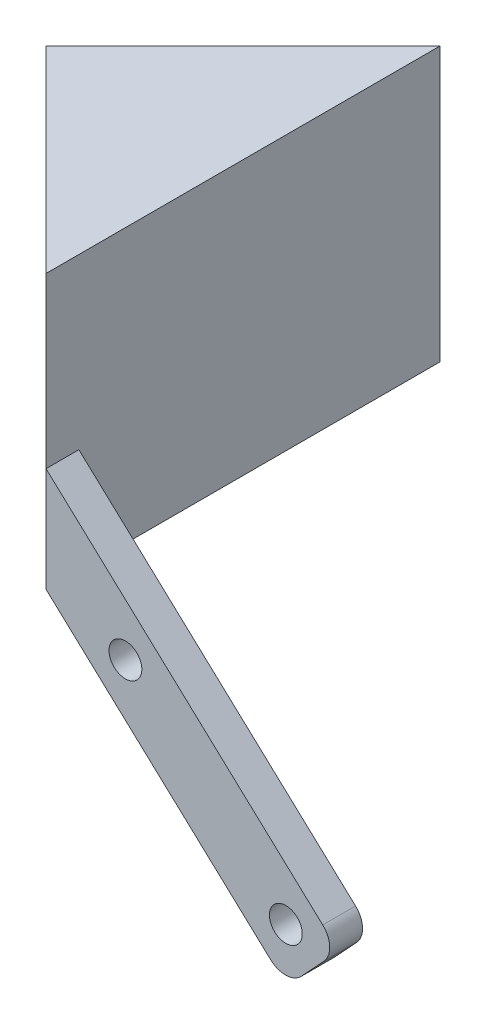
from build123d import *

# Parameters (mm, degrees)
ESQUISSE4_R                  = 1.5
BOSS_EXTRU_3_DEPTH           = 3
ESQUISSE5_W                  = 36
ESQUISSE5_H                  = 25
BOSS_EXTRU_4_DEPTH           = 18
ENL_V_MAT_EXTRU_2_DEPTH      = 1
ENL_V_MAT_EXTRU_2_DEPTH_BACK = 25
ENL_V_MAT_EXTRU_3_DEPTH      = 26
CONG_3_R                     = 2


with BuildPart() as part:
    # Esquisse4 → Boss.-Extru.3 (new body)
    with BuildSketch(Plane.XY):
        Polygon((-17.467540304, 6.147747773), (4.52219682, -14.259394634), (9.283863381, -9.128455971), (-12.705873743, 11.278686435), (-17.467540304, 15.697657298), align=None)
        with Locations((4.447509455, -9.415127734)):
            Circle(ESQUISSE4_R, mode=Mode.SUBTRACT)
        with Locations((-10.212315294, 4.189633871)):
            Circle(ESQUISSE4_R, mode=Mode.SUBTRACT)
    extrude(amount=BOSS_EXTRU_3_DEPTH)

    # Esquisse5 → Boss.-Extru.4 (add)
    with BuildSketch(Plane.ZY.offset(17.467540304)):
        with Locations((-15, 18.647747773)):
            Rectangle(ESQUISSE5_W, ESQUISSE5_H)
    extrude(amount=BOSS_EXTRU_4_DEPTH)

    # Esquisse6 → Enl_v. mat.-Extru.2 (cut, two sides: drawn at the far end of the back side and taken through both)
    with BuildSketch(Plane(origin=(0, 31.147747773, 0), x_dir=(1, 0, 0), z_dir=(0, 1, 0)).offset(-ENL_V_MAT_EXTRU_2_DEPTH_BACK)):
        Polygon((-35.467540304, -3), (-17.467540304, -3), (-35.467540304, 15), align=None)
    extrude(amount=ENL_V_MAT_EXTRU_2_DEPTH + ENL_V_MAT_EXTRU_2_DEPTH_BACK, mode=Mode.SUBTRACT)

    # Esquisse7 → Enl_v. mat.-Extru.3 (cut)
    with BuildSketch(Plane(origin=(0, 31.147747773, 0), x_dir=(1, 0, 0), z_dir=(0, 1, 0))):
        Polygon((-17.467540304, 33), (-35.467540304, 15), (-35.467540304, 33), align=None)
    extrude(amount=-ENL_V_MAT_EXTRU_3_DEPTH, mode=Mode.SUBTRACT)

    # Cong_3
    cong_3_edges = [part.edges().sort_by_distance(p)[0] for p in [
        (9.283863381, -9.128455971, 1.5),
        (4.52219682, -14.259394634, 1.5),
    ]]
    fillet(cong_3_edges, radius=CONG_3_R)


solid = part.part
